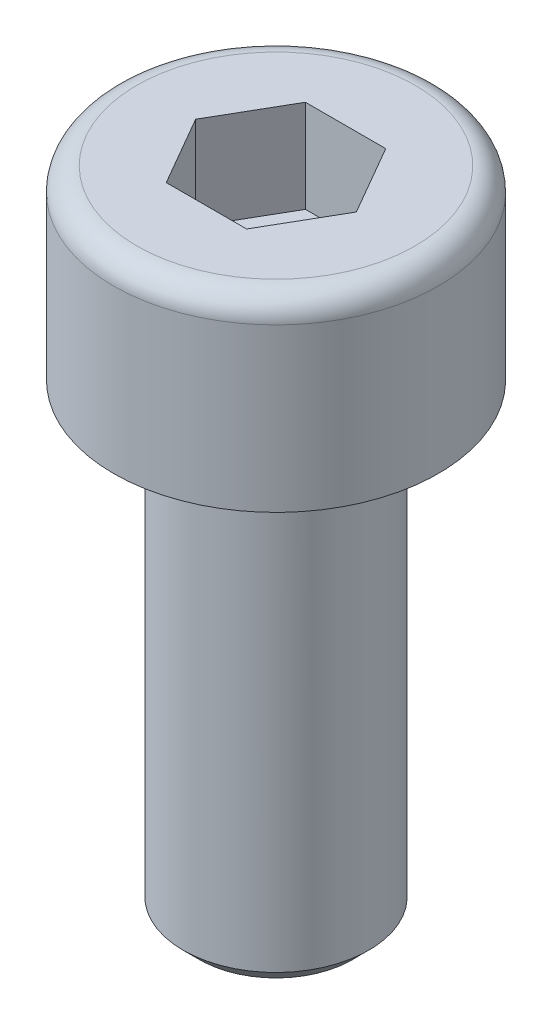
from build123d import *

# Parameters (mm, degrees)
ENL_V_MAT_EXTRU_1_DEPTH = 2
CHANFREIN1_SIZE         = 0.35


with BuildPart() as part:
    # Esquisse1 → Base-R_volution (revolve)
    with BuildSketch(Plane.XY, mode=Mode.PRIVATE) as base_r_volution_sk:
        with BuildLine():
            Line((0, 14), (-3, 14))
            ThreePointArc((-3, 14), (-3.353553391, 13.853553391), (-3.5, 13.5))
            Line((-3.5, 13.5), (-3.5, 10))
            Line((-3.5, 10), (-2, 10))
            Line((-2, 10), (-2, 0))
            Line((-2, 0), (0, 0))
            Line((0, 0), (0, 14))
        make_face()
    revolve(base_r_volution_sk.sketch.rotate(Axis((0, 21.761726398, 0), (0, -1, 0)), 270), axis=Axis((0, 21.761726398, 0), (0, -1, 0)))

    # Esquisse2 → Enl_v. mat.-Extru.1 (cut)
    with BuildSketch(Plane(origin=(0, 14, 0), x_dir=(-1, 0, 0), z_dir=(0, 1, 0))):
        Polygon((1.732050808, 0), (0.866025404, -1.5), (-0.866025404, -1.5), (-1.732050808, 0), (-0.866025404, 1.5), (0.866025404, 1.5), align=None)
    extrude(amount=-ENL_V_MAT_EXTRU_1_DEPTH, mode=Mode.SUBTRACT)

    # Chanfrein1
    chanfrein1_edges = [part.edges().sort_by_distance(p)[0] for p in [
        (0, 0, -2),
    ]]
    chamfer(chanfrein1_edges, length=CHANFREIN1_SIZE)


solid = part.part
